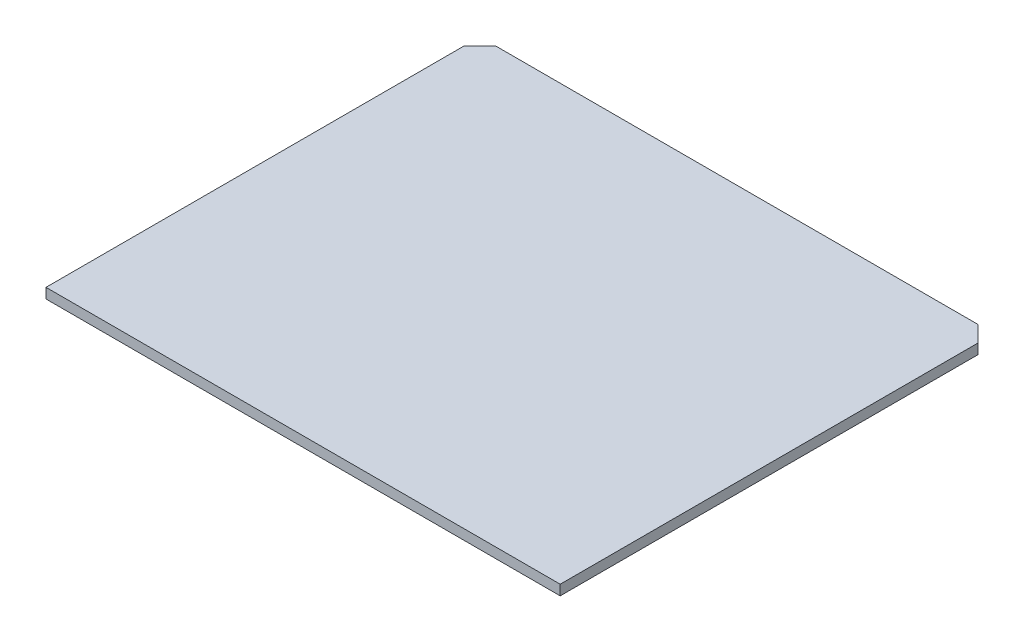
ISO-10303-21;
HEADER;
FILE_DESCRIPTION(('STEP AP214'),'2;1');
FILE_NAME('part.step','',(''),(''),'','','');
FILE_SCHEMA(('AUTOMOTIVE_DESIGN { 1 0 10303 214 1 1 1 1 }'));
ENDSEC;
DATA;
#1=APPLICATION_CONTEXT('core data for automotive mechanical design processes');
#2=APPLICATION_PROTOCOL_DEFINITION('international standard','automotive_design',2000,#1);
#3=PRODUCT_CONTEXT('',#1,'mechanical');
#4=PRODUCT('Part','Part','',(#3));
#5=PRODUCT_RELATED_PRODUCT_CATEGORY('part','',(#4));
#6=PRODUCT_DEFINITION_FORMATION('','',#4);
#7=PRODUCT_DEFINITION_CONTEXT('part definition',#1,'design');
#8=PRODUCT_DEFINITION('design','',#6,#7);
#9=PRODUCT_DEFINITION_SHAPE('','',#8);
#10=(LENGTH_UNIT() NAMED_UNIT(*) SI_UNIT(.MILLI.,.METRE.));
#11=(NAMED_UNIT(*) PLANE_ANGLE_UNIT() SI_UNIT($,.RADIAN.));
#12=(NAMED_UNIT(*) SI_UNIT($,.STERADIAN.) SOLID_ANGLE_UNIT());
#13=UNCERTAINTY_MEASURE_WITH_UNIT(LENGTH_MEASURE(1.E-05),#10,'distance_accuracy_value','');
#14=(GEOMETRIC_REPRESENTATION_CONTEXT(3) GLOBAL_UNCERTAINTY_ASSIGNED_CONTEXT((#13)) GLOBAL_UNIT_ASSIGNED_CONTEXT((#10,
#11,#12)) REPRESENTATION_CONTEXT('',''));
#15=CARTESIAN_POINT('',(0.,0.,0.));
#16=DIRECTION('',(0.,0.,1.));
#17=DIRECTION('',(1.,0.,0.));
#18=AXIS2_PLACEMENT_3D('',#15,#16,#17);
#19=CARTESIAN_POINT('',(40.64,1.6,-34.29));
#20=DIRECTION('',(-1.,0.,0.));
#21=DIRECTION('',(0.,0.,1.));
#22=AXIS2_PLACEMENT_3D('',#19,#20,#21);
#23=PLANE('',#22);
#24=DIRECTION('',(0.,0.,-1.));
#25=VECTOR('',#24,1.);
#26=CARTESIAN_POINT('',(40.64,0.,-34.29));
#27=LINE('',#26,#25);
#28=CARTESIAN_POINT('',(40.64,0.,34.29));
#29=VERTEX_POINT('',#28);
#30=CARTESIAN_POINT('',(40.64,0.,-31.75));
#31=VERTEX_POINT('',#30);
#32=EDGE_CURVE('E109',#29,#31,#27,.T.);
#33=ORIENTED_EDGE('',*,*,#32,.T.);
#34=DIRECTION('',(0.,1.,0.));
#35=VECTOR('',#34,1.);
#36=CARTESIAN_POINT('',(40.64,1.6,-31.75));
#37=LINE('',#36,#35);
#38=CARTESIAN_POINT('',(40.64,1.6,-31.75));
#39=VERTEX_POINT('',#38);
#40=EDGE_CURVE('E53',#31,#39,#37,.T.);
#41=ORIENTED_EDGE('',*,*,#40,.T.);
#42=DIRECTION('',(0.,0.,-1.));
#43=VECTOR('',#42,1.);
#44=CARTESIAN_POINT('',(40.64,1.6,-34.29));
#45=LINE('',#44,#43);
#46=CARTESIAN_POINT('',(40.64,1.6,34.29));
#47=VERTEX_POINT('',#46);
#48=EDGE_CURVE('E116',#47,#39,#45,.T.);
#49=ORIENTED_EDGE('',*,*,#48,.F.);
#50=DIRECTION('',(0.,-1.,0.));
#51=VECTOR('',#50,1.);
#52=CARTESIAN_POINT('',(40.64,1.6,34.29));
#53=LINE('',#52,#51);
#54=EDGE_CURVE('E101',#47,#29,#53,.T.);
#55=ORIENTED_EDGE('',*,*,#54,.T.);
#56=EDGE_LOOP('',(#33,#41,#49,#55));
#57=FACE_BOUND('',#56,.T.);
#58=ADVANCED_FACE('F30',(#57),#23,.F.);
#59=CARTESIAN_POINT('',(-40.64,1.6,-34.29));
#60=DIRECTION('',(0.,0.,1.));
#61=DIRECTION('',(1.,0.,0.));
#62=AXIS2_PLACEMENT_3D('',#59,#60,#61);
#63=PLANE('',#62);
#64=DIRECTION('',(-1.,0.,0.));
#65=VECTOR('',#64,1.);
#66=CARTESIAN_POINT('',(-40.64,1.6,-34.29));
#67=LINE('',#66,#65);
#68=CARTESIAN_POINT('',(38.1,1.6,-34.29));
#69=VERTEX_POINT('',#68);
#70=CARTESIAN_POINT('',(-38.1,1.6,-34.29));
#71=VERTEX_POINT('',#70);
#72=EDGE_CURVE('E91',#69,#71,#67,.T.);
#73=ORIENTED_EDGE('',*,*,#72,.F.);
#74=DIRECTION('',(0.,-1.,0.));
#75=VECTOR('',#74,1.);
#76=CARTESIAN_POINT('',(38.1,1.6,-34.29));
#77=LINE('',#76,#75);
#78=CARTESIAN_POINT('',(38.1,0.,-34.29));
#79=VERTEX_POINT('',#78);
#80=EDGE_CURVE('E119',#69,#79,#77,.T.);
#81=ORIENTED_EDGE('',*,*,#80,.T.);
#82=DIRECTION('',(-1.,0.,0.));
#83=VECTOR('',#82,1.);
#84=CARTESIAN_POINT('',(-40.64,0.,-34.29));
#85=LINE('',#84,#83);
#86=CARTESIAN_POINT('',(-38.1,0.,-34.29));
#87=VERTEX_POINT('',#86);
#88=EDGE_CURVE('E111',#79,#87,#85,.T.);
#89=ORIENTED_EDGE('',*,*,#88,.T.);
#90=DIRECTION('',(0.,1.,0.));
#91=VECTOR('',#90,1.);
#92=CARTESIAN_POINT('',(-38.1,1.6,-34.29));
#93=LINE('',#92,#91);
#94=EDGE_CURVE('E100',#87,#71,#93,.T.);
#95=ORIENTED_EDGE('',*,*,#94,.T.);
#96=EDGE_LOOP('',(#73,#81,#89,#95));
#97=FACE_BOUND('',#96,.T.);
#98=ADVANCED_FACE('F132',(#97),#63,.F.);
#99=CARTESIAN_POINT('',(-40.64,1.6,-34.29));
#100=DIRECTION('',(1.,0.,0.));
#101=DIRECTION('',(0.,0.,-1.));
#102=AXIS2_PLACEMENT_3D('',#99,#100,#101);
#103=PLANE('',#102);
#104=DIRECTION('',(0.,0.,1.));
#105=VECTOR('',#104,1.);
#106=CARTESIAN_POINT('',(-40.64,1.6,-34.29));
#107=LINE('',#106,#105);
#108=CARTESIAN_POINT('',(-40.64,1.6,-31.75));
#109=VERTEX_POINT('',#108);
#110=CARTESIAN_POINT('',(-40.64,1.6,34.29));
#111=VERTEX_POINT('',#110);
#112=EDGE_CURVE('E83',#109,#111,#107,.T.);
#113=ORIENTED_EDGE('',*,*,#112,.F.);
#114=DIRECTION('',(0.,-1.,0.));
#115=VECTOR('',#114,1.);
#116=CARTESIAN_POINT('',(-40.64,1.6,-31.75));
#117=LINE('',#116,#115);
#118=CARTESIAN_POINT('',(-40.64,0.,-31.75));
#119=VERTEX_POINT('',#118);
#120=EDGE_CURVE('E11',#109,#119,#117,.T.);
#121=ORIENTED_EDGE('',*,*,#120,.T.);
#122=DIRECTION('',(0.,0.,1.));
#123=VECTOR('',#122,1.);
#124=CARTESIAN_POINT('',(-40.64,0.,-34.29));
#125=LINE('',#124,#123);
#126=CARTESIAN_POINT('',(-40.64,0.,34.29));
#127=VERTEX_POINT('',#126);
#128=EDGE_CURVE('E97',#119,#127,#125,.T.);
#129=ORIENTED_EDGE('',*,*,#128,.T.);
#130=DIRECTION('',(0.,-1.,0.));
#131=VECTOR('',#130,1.);
#132=CARTESIAN_POINT('',(-40.64,1.6,34.29));
#133=LINE('',#132,#131);
#134=EDGE_CURVE('E94',#111,#127,#133,.T.);
#135=ORIENTED_EDGE('',*,*,#134,.F.);
#136=EDGE_LOOP('',(#113,#121,#129,#135));
#137=FACE_BOUND('',#136,.T.);
#138=ADVANCED_FACE('F95',(#137),#103,.F.);
#139=CARTESIAN_POINT('',(-40.64,1.6,34.29));
#140=DIRECTION('',(0.,0.,-1.));
#141=DIRECTION('',(-1.,0.,0.));
#142=AXIS2_PLACEMENT_3D('',#139,#140,#141);
#143=PLANE('',#142);
#144=DIRECTION('',(1.,0.,0.));
#145=VECTOR('',#144,1.);
#146=CARTESIAN_POINT('',(-40.64,0.,34.29));
#147=LINE('',#146,#145);
#148=EDGE_CURVE('E115',#127,#29,#147,.T.);
#149=ORIENTED_EDGE('',*,*,#148,.T.);
#150=ORIENTED_EDGE('',*,*,#54,.F.);
#151=DIRECTION('',(1.,0.,0.));
#152=VECTOR('',#151,1.);
#153=CARTESIAN_POINT('',(-40.64,1.6,34.29));
#154=LINE('',#153,#152);
#155=EDGE_CURVE('E87',#111,#47,#154,.T.);
#156=ORIENTED_EDGE('',*,*,#155,.F.);
#157=ORIENTED_EDGE('',*,*,#134,.T.);
#158=EDGE_LOOP('',(#149,#150,#156,#157));
#159=FACE_BOUND('',#158,.T.);
#160=ADVANCED_FACE('F103',(#159),#143,.F.);
#161=CARTESIAN_POINT('',(40.64,1.6,34.29));
#162=DIRECTION('',(0.,1.,0.));
#163=DIRECTION('',(0.,0.,1.));
#164=AXIS2_PLACEMENT_3D('',#161,#162,#163);
#165=PLANE('',#164);
#166=ORIENTED_EDGE('',*,*,#48,.T.);
#167=DIRECTION('',(0.707106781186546,0.,0.707106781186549));
#168=VECTOR('',#167,1.);
#169=CARTESIAN_POINT('',(73.66,1.6,1.27000000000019));
#170=LINE('',#169,#168);
#171=EDGE_CURVE('E38',#39,#69,#170,.F.);
#172=ORIENTED_EDGE('',*,*,#171,.T.);
#173=ORIENTED_EDGE('',*,*,#72,.T.);
#174=DIRECTION('',(0.707106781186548,0.,-0.707106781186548));
#175=VECTOR('',#174,1.);
#176=CARTESIAN_POINT('',(-33.02,1.6,-39.37));
#177=LINE('',#176,#175);
#178=EDGE_CURVE('E45',#71,#109,#177,.F.);
#179=ORIENTED_EDGE('',*,*,#178,.T.);
#180=ORIENTED_EDGE('',*,*,#112,.T.);
#181=ORIENTED_EDGE('',*,*,#155,.T.);
#182=EDGE_LOOP('',(#166,#172,#173,#179,#180,#181));
#183=FACE_BOUND('',#182,.T.);
#184=ADVANCED_FACE('F85',(#183),#165,.T.);
#185=CARTESIAN_POINT('',(40.64,0.,34.29));
#186=DIRECTION('',(0.,1.,0.));
#187=DIRECTION('',(0.,0.,1.));
#188=AXIS2_PLACEMENT_3D('',#185,#186,#187);
#189=PLANE('',#188);
#190=ORIENTED_EDGE('',*,*,#88,.F.);
#191=DIRECTION('',(-0.707106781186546,0.,-0.707106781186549));
#192=VECTOR('',#191,1.);
#193=CARTESIAN_POINT('',(38.1,0.,-34.29));
#194=LINE('',#193,#192);
#195=EDGE_CURVE('E124',#79,#31,#194,.F.);
#196=ORIENTED_EDGE('',*,*,#195,.T.);
#197=ORIENTED_EDGE('',*,*,#32,.F.);
#198=ORIENTED_EDGE('',*,*,#148,.F.);
#199=ORIENTED_EDGE('',*,*,#128,.F.);
#200=DIRECTION('',(-0.707106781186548,0.,0.707106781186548));
#201=VECTOR('',#200,1.);
#202=CARTESIAN_POINT('',(-40.64,0.,-31.75));
#203=LINE('',#202,#201);
#204=EDGE_CURVE('E122',#119,#87,#203,.F.);
#205=ORIENTED_EDGE('',*,*,#204,.T.);
#206=EDGE_LOOP('',(#190,#196,#197,#198,#199,#205));
#207=FACE_BOUND('',#206,.T.);
#208=ADVANCED_FACE('F138',(#207),#189,.F.);
#209=CARTESIAN_POINT('',(38.1,1.6,-34.29));
#210=DIRECTION('',(-0.707106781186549,0.,0.707106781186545));
#211=DIRECTION('',(0.707106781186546,0.,0.707106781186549));
#212=AXIS2_PLACEMENT_3D('',#209,#210,#211);
#213=PLANE('',#212);
#214=ORIENTED_EDGE('',*,*,#171,.F.);
#215=ORIENTED_EDGE('',*,*,#40,.F.);
#216=ORIENTED_EDGE('',*,*,#195,.F.);
#217=ORIENTED_EDGE('',*,*,#80,.F.);
#218=EDGE_LOOP('',(#214,#215,#216,#217));
#219=FACE_BOUND('',#218,.T.);
#220=ADVANCED_FACE('F135',(#219),#213,.F.);
#221=CARTESIAN_POINT('',(-40.64,1.6,-31.75));
#222=DIRECTION('',(0.707106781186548,0.,0.707106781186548));
#223=DIRECTION('',(0.707106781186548,0.,-0.707106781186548));
#224=AXIS2_PLACEMENT_3D('',#221,#222,#223);
#225=PLANE('',#224);
#226=ORIENTED_EDGE('',*,*,#178,.F.);
#227=ORIENTED_EDGE('',*,*,#94,.F.);
#228=ORIENTED_EDGE('',*,*,#204,.F.);
#229=ORIENTED_EDGE('',*,*,#120,.F.);
#230=EDGE_LOOP('',(#226,#227,#228,#229));
#231=FACE_BOUND('',#230,.T.);
#232=ADVANCED_FACE('F32',(#231),#225,.F.);
#233=CLOSED_SHELL('',(#58,#98,#138,#160,#184,#208,#220,#232));
#234=MANIFOLD_SOLID_BREP('B2',#233);
#235=ADVANCED_BREP_SHAPE_REPRESENTATION('',(#18,#234),#14);
#236=SHAPE_DEFINITION_REPRESENTATION(#9,#235);
ENDSEC;
END-ISO-10303-21;
